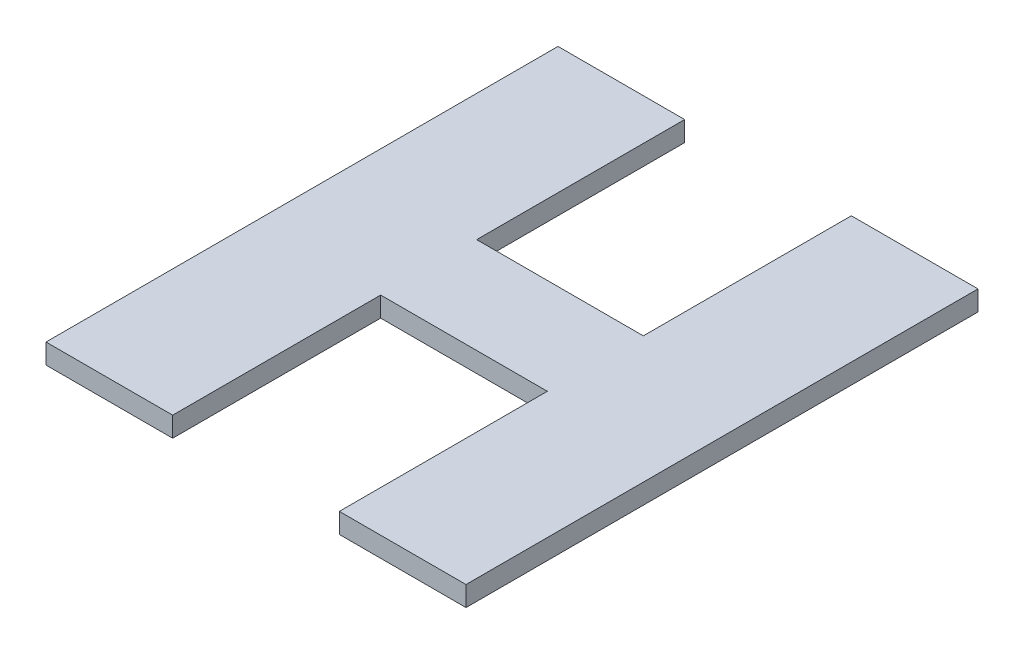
from build123d import *

# Parameters (mm, degrees)
SKETCH1_W          = 16.002
SKETCH1_H          = 19.5072
EXTRUDE1_DEPTH     = 0.381
SKETCH2_W          = 6.35
SKETCH2_H          = 7.9248
CUT_EXTRUDE1_DEPTH = 13.638408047


with BuildPart() as part:
    # Sketch1 → Extrude1 (new, symmetric)
    with BuildSketch(Plane(origin=(0, 0, 0), x_dir=(1, 0, 0), z_dir=(0, 1, 0))):
        Rectangle(SKETCH1_W, SKETCH1_H)
    extrude(amount=EXTRUDE1_DEPTH, both=True)

    # Sketch2 → Cut-Extrude1 (cut, through all)
    with BuildSketch(Plane(origin=(0, 0.381, 0), x_dir=(-1, 0, 0), z_dir=(0, 1, 0))):
        with Locations((0, 5.7912)):
            Rectangle(SKETCH2_W, SKETCH2_H)
        with Locations((0, -5.7912)):
            Rectangle(SKETCH2_W, SKETCH2_H)
    extrude(amount=-CUT_EXTRUDE1_DEPTH, mode=Mode.SUBTRACT)


solid = part.part
